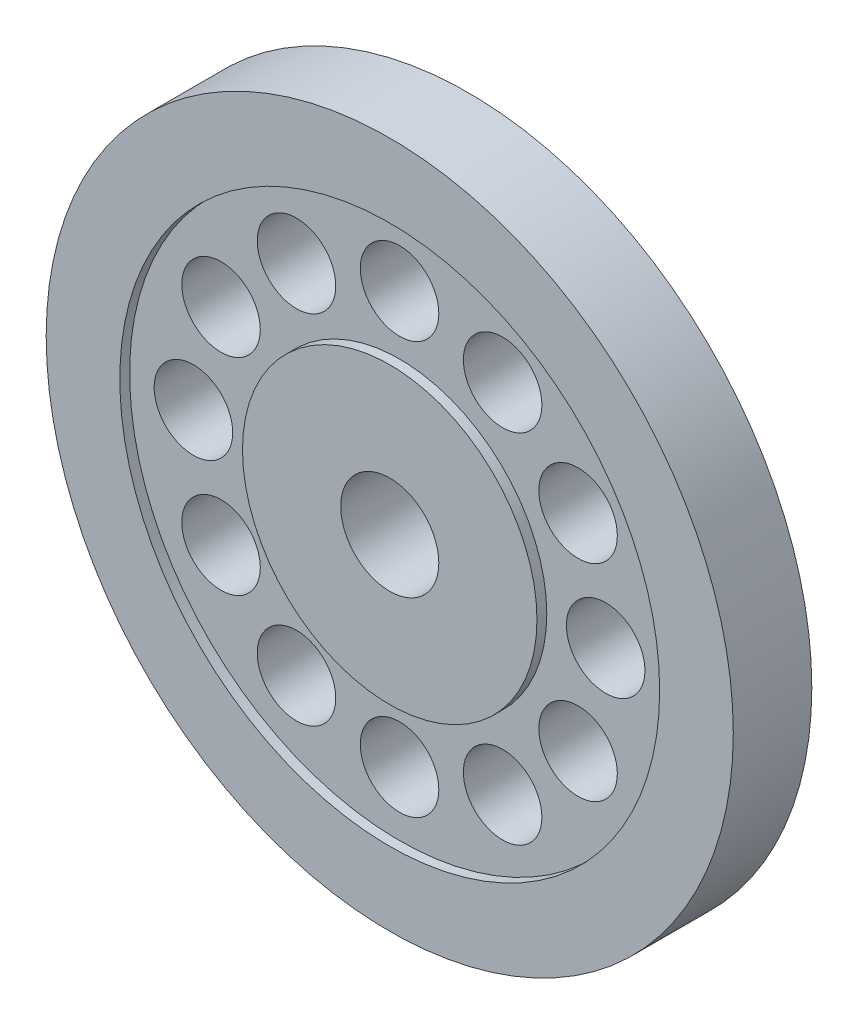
ISO-10303-21;
HEADER;
FILE_DESCRIPTION(('STEP AP214'),'2;1');
FILE_NAME('part.step','',(''),(''),'','','');
FILE_SCHEMA(('AUTOMOTIVE_DESIGN { 1 0 10303 214 1 1 1 1 }'));
ENDSEC;
DATA;
#1=APPLICATION_CONTEXT('core data for automotive mechanical design processes');
#2=APPLICATION_PROTOCOL_DEFINITION('international standard','automotive_design',2000,#1);
#3=PRODUCT_CONTEXT('',#1,'mechanical');
#4=PRODUCT('Part','Part','',(#3));
#5=PRODUCT_RELATED_PRODUCT_CATEGORY('part','',(#4));
#6=PRODUCT_DEFINITION_FORMATION('','',#4);
#7=PRODUCT_DEFINITION_CONTEXT('part definition',#1,'design');
#8=PRODUCT_DEFINITION('design','',#6,#7);
#9=PRODUCT_DEFINITION_SHAPE('','',#8);
#10=(LENGTH_UNIT() NAMED_UNIT(*) SI_UNIT(.MILLI.,.METRE.));
#11=(NAMED_UNIT(*) PLANE_ANGLE_UNIT() SI_UNIT($,.RADIAN.));
#12=(NAMED_UNIT(*) SI_UNIT($,.STERADIAN.) SOLID_ANGLE_UNIT());
#13=UNCERTAINTY_MEASURE_WITH_UNIT(LENGTH_MEASURE(1.E-05),#10,'distance_accuracy_value','');
#14=(GEOMETRIC_REPRESENTATION_CONTEXT(3) GLOBAL_UNCERTAINTY_ASSIGNED_CONTEXT((#13)) GLOBAL_UNIT_ASSIGNED_CONTEXT((#10,
#11,#12)) REPRESENTATION_CONTEXT('',''));
#15=CARTESIAN_POINT('',(0.,0.,0.));
#16=DIRECTION('',(0.,0.,1.));
#17=DIRECTION('',(1.,0.,0.));
#18=AXIS2_PLACEMENT_3D('',#15,#16,#17);
#19=CARTESIAN_POINT('',(0.,0.,8.));
#20=DIRECTION('',(0.,0.,-1.));
#21=DIRECTION('',(-1.,0.,0.));
#22=AXIS2_PLACEMENT_3D('',#19,#20,#21);
#23=CYLINDRICAL_SURFACE('',#22,35.);
#24=CARTESIAN_POINT('',(0.,0.,8.));
#25=DIRECTION('',(0.,0.,1.));
#26=DIRECTION('',(1.,0.,0.));
#27=AXIS2_PLACEMENT_3D('',#24,#25,#26);
#28=CIRCLE('',#27,35.);
#29=CARTESIAN_POINT('',(35.,0.,8.));
#30=VERTEX_POINT('',#29);
#31=EDGE_CURVE('E10',#30,#30,#28,.T.);
#32=ORIENTED_EDGE('',*,*,#31,.F.);
#33=EDGE_LOOP('',(#32));
#34=FACE_BOUND('',#33,.T.);
#35=CARTESIAN_POINT('',(0.,0.,0.));
#36=DIRECTION('',(0.,0.,1.));
#37=DIRECTION('',(1.,0.,0.));
#38=AXIS2_PLACEMENT_3D('',#35,#36,#37);
#39=CIRCLE('',#38,35.);
#40=CARTESIAN_POINT('',(35.,0.,0.));
#41=VERTEX_POINT('',#40);
#42=EDGE_CURVE('E39',#41,#41,#39,.T.);
#43=ORIENTED_EDGE('',*,*,#42,.T.);
#44=EDGE_LOOP('',(#43));
#45=FACE_BOUND('',#44,.T.);
#46=ADVANCED_FACE('F36',(#34,#45),#23,.T.);
#47=CARTESIAN_POINT('',(0.,0.,8.));
#48=DIRECTION('',(0.,0.,1.));
#49=DIRECTION('',(1.,0.,0.));
#50=AXIS2_PLACEMENT_3D('',#47,#48,#49);
#51=PLANE('',#50);
#52=CARTESIAN_POINT('',(0.,0.,8.));
#53=DIRECTION('',(0.,0.,1.));
#54=DIRECTION('',(1.,0.,0.));
#55=AXIS2_PLACEMENT_3D('',#52,#53,#54);
#56=CIRCLE('',#55,27.5);
#57=CARTESIAN_POINT('',(27.5,0.,8.));
#58=VERTEX_POINT('',#57);
#59=EDGE_CURVE('E51',#58,#58,#56,.T.);
#60=ORIENTED_EDGE('',*,*,#59,.F.);
#61=EDGE_LOOP('',(#60));
#62=FACE_BOUND('',#61,.T.);
#63=ORIENTED_EDGE('',*,*,#31,.T.);
#64=EDGE_LOOP('',(#63));
#65=FACE_BOUND('',#64,.T.);
#66=ADVANCED_FACE('F194',(#62,#65),#51,.T.);
#67=CARTESIAN_POINT('',(0.,0.,0.));
#68=DIRECTION('',(0.,0.,1.));
#69=DIRECTION('',(1.,0.,0.));
#70=AXIS2_PLACEMENT_3D('',#67,#68,#69);
#71=PLANE('',#70);
#72=CARTESIAN_POINT('',(-10.4999999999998,18.1865334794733,0.));
#73=DIRECTION('',(0.,0.,1.));
#74=DIRECTION('',(1.,0.,0.));
#75=AXIS2_PLACEMENT_3D('',#72,#73,#74);
#76=CIRCLE('',#75,4.);
#77=CARTESIAN_POINT('',(-6.49999999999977,18.1865334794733,0.));
#78=VERTEX_POINT('',#77);
#79=EDGE_CURVE('E147',#78,#78,#76,.T.);
#80=ORIENTED_EDGE('',*,*,#79,.T.);
#81=EDGE_LOOP('',(#80));
#82=FACE_BOUND('',#81,.T.);
#83=CARTESIAN_POINT('',(-18.1865334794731,10.5000000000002,0.));
#84=DIRECTION('',(0.,0.,1.));
#85=DIRECTION('',(1.,0.,0.));
#86=AXIS2_PLACEMENT_3D('',#83,#84,#85);
#87=CIRCLE('',#86,4.);
#88=CARTESIAN_POINT('',(-14.1865334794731,10.5000000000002,0.));
#89=VERTEX_POINT('',#88);
#90=EDGE_CURVE('E141',#89,#89,#87,.T.);
#91=ORIENTED_EDGE('',*,*,#90,.T.);
#92=EDGE_LOOP('',(#91));
#93=FACE_BOUND('',#92,.T.);
#94=CARTESIAN_POINT('',(-21.,2.19963324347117E-13,0.));
#95=DIRECTION('',(0.,0.,1.));
#96=DIRECTION('',(1.,0.,0.));
#97=AXIS2_PLACEMENT_3D('',#94,#95,#96);
#98=CIRCLE('',#97,4.);
#99=CARTESIAN_POINT('',(-17.,2.19963324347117E-13,0.));
#100=VERTEX_POINT('',#99);
#101=EDGE_CURVE('E135',#100,#100,#98,.T.);
#102=ORIENTED_EDGE('',*,*,#101,.T.);
#103=EDGE_LOOP('',(#102));
#104=FACE_BOUND('',#103,.T.);
#105=CARTESIAN_POINT('',(-18.1865334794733,-10.4999999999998,0.));
#106=DIRECTION('',(0.,0.,1.));
#107=DIRECTION('',(1.,0.,0.));
#108=AXIS2_PLACEMENT_3D('',#105,#106,#107);
#109=CIRCLE('',#108,4.);
#110=CARTESIAN_POINT('',(-14.1865334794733,-10.4999999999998,0.));
#111=VERTEX_POINT('',#110);
#112=EDGE_CURVE('E128',#111,#111,#109,.T.);
#113=ORIENTED_EDGE('',*,*,#112,.T.);
#114=EDGE_LOOP('',(#113));
#115=FACE_BOUND('',#114,.T.);
#116=CARTESIAN_POINT('',(-10.5000000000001,-18.1865334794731,0.));
#117=DIRECTION('',(0.,0.,1.));
#118=DIRECTION('',(1.,0.,0.));
#119=AXIS2_PLACEMENT_3D('',#116,#117,#118);
#120=CIRCLE('',#119,4.);
#121=CARTESIAN_POINT('',(-6.50000000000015,-18.1865334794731,0.));
#122=VERTEX_POINT('',#121);
#123=EDGE_CURVE('E120',#122,#122,#120,.T.);
#124=ORIENTED_EDGE('',*,*,#123,.T.);
#125=EDGE_LOOP('',(#124));
#126=FACE_BOUND('',#125,.T.);
#127=CARTESIAN_POINT('',(0.,-21.,0.));
#128=DIRECTION('',(0.,0.,1.));
#129=DIRECTION('',(1.,0.,0.));
#130=AXIS2_PLACEMENT_3D('',#127,#128,#129);
#131=CIRCLE('',#130,4.);
#132=CARTESIAN_POINT('',(4.,-21.,0.));
#133=VERTEX_POINT('',#132);
#134=EDGE_CURVE('E112',#133,#133,#131,.T.);
#135=ORIENTED_EDGE('',*,*,#134,.T.);
#136=EDGE_LOOP('',(#135));
#137=FACE_BOUND('',#136,.T.);
#138=CARTESIAN_POINT('',(10.4999999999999,-18.1865334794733,0.));
#139=DIRECTION('',(0.,0.,1.));
#140=DIRECTION('',(1.,0.,0.));
#141=AXIS2_PLACEMENT_3D('',#138,#139,#140);
#142=CIRCLE('',#141,4.);
#143=CARTESIAN_POINT('',(14.4999999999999,-18.1865334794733,0.));
#144=VERTEX_POINT('',#143);
#145=EDGE_CURVE('E104',#144,#144,#142,.T.);
#146=ORIENTED_EDGE('',*,*,#145,.T.);
#147=EDGE_LOOP('',(#146));
#148=FACE_BOUND('',#147,.T.);
#149=CARTESIAN_POINT('',(18.1865334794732,-10.5000000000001,0.));
#150=DIRECTION('',(0.,0.,1.));
#151=DIRECTION('',(1.,0.,0.));
#152=AXIS2_PLACEMENT_3D('',#149,#150,#151);
#153=CIRCLE('',#152,4.);
#154=CARTESIAN_POINT('',(22.1865334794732,-10.5000000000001,0.));
#155=VERTEX_POINT('',#154);
#156=EDGE_CURVE('E96',#155,#155,#153,.T.);
#157=ORIENTED_EDGE('',*,*,#156,.T.);
#158=EDGE_LOOP('',(#157));
#159=FACE_BOUND('',#158,.T.);
#160=CARTESIAN_POINT('',(21.,0.,0.));
#161=DIRECTION('',(0.,0.,1.));
#162=DIRECTION('',(1.,0.,0.));
#163=AXIS2_PLACEMENT_3D('',#160,#161,#162);
#164=CIRCLE('',#163,4.);
#165=CARTESIAN_POINT('',(25.,0.,0.));
#166=VERTEX_POINT('',#165);
#167=EDGE_CURVE('E90',#166,#166,#164,.T.);
#168=ORIENTED_EDGE('',*,*,#167,.T.);
#169=EDGE_LOOP('',(#168));
#170=FACE_BOUND('',#169,.T.);
#171=CARTESIAN_POINT('',(18.1865334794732,10.5,0.));
#172=DIRECTION('',(0.,0.,1.));
#173=DIRECTION('',(1.,0.,0.));
#174=AXIS2_PLACEMENT_3D('',#171,#172,#173);
#175=CIRCLE('',#174,4.);
#176=CARTESIAN_POINT('',(22.1865334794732,10.5,0.));
#177=VERTEX_POINT('',#176);
#178=EDGE_CURVE('E84',#177,#177,#175,.T.);
#179=ORIENTED_EDGE('',*,*,#178,.T.);
#180=EDGE_LOOP('',(#179));
#181=FACE_BOUND('',#180,.T.);
#182=CARTESIAN_POINT('',(10.5,18.1865334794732,0.));
#183=DIRECTION('',(0.,0.,1.));
#184=DIRECTION('',(1.,0.,0.));
#185=AXIS2_PLACEMENT_3D('',#182,#183,#184);
#186=CIRCLE('',#185,4.);
#187=CARTESIAN_POINT('',(14.5,18.1865334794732,0.));
#188=VERTEX_POINT('',#187);
#189=EDGE_CURVE('E78',#188,#188,#186,.T.);
#190=ORIENTED_EDGE('',*,*,#189,.T.);
#191=EDGE_LOOP('',(#190));
#192=FACE_BOUND('',#191,.T.);
#193=CARTESIAN_POINT('',(0.,21.,0.));
#194=DIRECTION('',(0.,0.,1.));
#195=DIRECTION('',(1.,0.,0.));
#196=AXIS2_PLACEMENT_3D('',#193,#194,#195);
#197=CIRCLE('',#196,4.);
#198=CARTESIAN_POINT('',(4.,21.,0.));
#199=VERTEX_POINT('',#198);
#200=EDGE_CURVE('E72',#199,#199,#197,.T.);
#201=ORIENTED_EDGE('',*,*,#200,.T.);
#202=EDGE_LOOP('',(#201));
#203=FACE_BOUND('',#202,.T.);
#204=CARTESIAN_POINT('',(0.,0.,0.));
#205=DIRECTION('',(0.,0.,1.));
#206=DIRECTION('',(1.,0.,0.));
#207=AXIS2_PLACEMENT_3D('',#204,#205,#206);
#208=CIRCLE('',#207,5.);
#209=CARTESIAN_POINT('',(5.,0.,0.));
#210=VERTEX_POINT('',#209);
#211=EDGE_CURVE('E63',#210,#210,#208,.T.);
#212=ORIENTED_EDGE('',*,*,#211,.T.);
#213=EDGE_LOOP('',(#212));
#214=FACE_BOUND('',#213,.T.);
#215=ORIENTED_EDGE('',*,*,#42,.F.);
#216=EDGE_LOOP('',(#215));
#217=FACE_BOUND('',#216,.T.);
#218=ADVANCED_FACE('F190',(#82,#93,#104,#115,#126,#137,#148,#159,#170,#181,#192,#203,#214,#217),
#71,.F.);
#219=CARTESIAN_POINT('',(0.,0.,7.));
#220=DIRECTION('',(0.,0.,1.));
#221=DIRECTION('',(1.,0.,0.));
#222=AXIS2_PLACEMENT_3D('',#219,#220,#221);
#223=CYLINDRICAL_SURFACE('',#222,27.5);
#224=CARTESIAN_POINT('',(0.,0.,7.));
#225=DIRECTION('',(0.,0.,1.));
#226=DIRECTION('',(1.,0.,0.));
#227=AXIS2_PLACEMENT_3D('',#224,#225,#226);
#228=CIRCLE('',#227,27.5);
#229=CARTESIAN_POINT('',(27.5,0.,7.));
#230=VERTEX_POINT('',#229);
#231=EDGE_CURVE('E49',#230,#230,#228,.T.);
#232=ORIENTED_EDGE('',*,*,#231,.F.);
#233=EDGE_LOOP('',(#232));
#234=FACE_BOUND('',#233,.T.);
#235=ORIENTED_EDGE('',*,*,#59,.T.);
#236=EDGE_LOOP('',(#235));
#237=FACE_BOUND('',#236,.T.);
#238=ADVANCED_FACE('F160',(#234,#237),#223,.F.);
#239=CARTESIAN_POINT('',(0.,0.,7.));
#240=DIRECTION('',(0.,0.,1.));
#241=DIRECTION('',(1.,0.,0.));
#242=AXIS2_PLACEMENT_3D('',#239,#240,#241);
#243=PLANE('',#242);
#244=CARTESIAN_POINT('',(-10.4999999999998,18.1865334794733,7.));
#245=DIRECTION('',(0.,0.,1.));
#246=DIRECTION('',(1.,0.,0.));
#247=AXIS2_PLACEMENT_3D('',#244,#245,#246);
#248=CIRCLE('',#247,4.);
#249=CARTESIAN_POINT('',(-6.49999999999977,18.1865334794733,7.));
#250=VERTEX_POINT('',#249);
#251=EDGE_CURVE('E150',#250,#250,#248,.T.);
#252=ORIENTED_EDGE('',*,*,#251,.F.);
#253=EDGE_LOOP('',(#252));
#254=FACE_BOUND('',#253,.T.);
#255=CARTESIAN_POINT('',(-18.1865334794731,10.5000000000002,7.));
#256=DIRECTION('',(0.,0.,1.));
#257=DIRECTION('',(1.,0.,0.));
#258=AXIS2_PLACEMENT_3D('',#255,#256,#257);
#259=CIRCLE('',#258,4.);
#260=CARTESIAN_POINT('',(-14.1865334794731,10.5000000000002,7.));
#261=VERTEX_POINT('',#260);
#262=EDGE_CURVE('E144',#261,#261,#259,.T.);
#263=ORIENTED_EDGE('',*,*,#262,.F.);
#264=EDGE_LOOP('',(#263));
#265=FACE_BOUND('',#264,.T.);
#266=CARTESIAN_POINT('',(-21.,2.19963324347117E-13,7.));
#267=DIRECTION('',(0.,0.,1.));
#268=DIRECTION('',(1.,0.,0.));
#269=AXIS2_PLACEMENT_3D('',#266,#267,#268);
#270=CIRCLE('',#269,4.);
#271=CARTESIAN_POINT('',(-17.,2.19963324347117E-13,7.));
#272=VERTEX_POINT('',#271);
#273=EDGE_CURVE('E138',#272,#272,#270,.T.);
#274=ORIENTED_EDGE('',*,*,#273,.F.);
#275=EDGE_LOOP('',(#274));
#276=FACE_BOUND('',#275,.T.);
#277=CARTESIAN_POINT('',(-18.1865334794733,-10.4999999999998,7.));
#278=DIRECTION('',(0.,0.,1.));
#279=DIRECTION('',(1.,0.,0.));
#280=AXIS2_PLACEMENT_3D('',#277,#278,#279);
#281=CIRCLE('',#280,4.);
#282=CARTESIAN_POINT('',(-14.1865334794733,-10.4999999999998,7.));
#283=VERTEX_POINT('',#282);
#284=EDGE_CURVE('E131',#283,#283,#281,.T.);
#285=ORIENTED_EDGE('',*,*,#284,.F.);
#286=EDGE_LOOP('',(#285));
#287=FACE_BOUND('',#286,.T.);
#288=CARTESIAN_POINT('',(-10.5000000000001,-18.1865334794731,7.));
#289=DIRECTION('',(0.,0.,1.));
#290=DIRECTION('',(1.,0.,0.));
#291=AXIS2_PLACEMENT_3D('',#288,#289,#290);
#292=CIRCLE('',#291,4.);
#293=CARTESIAN_POINT('',(-6.50000000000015,-18.1865334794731,7.));
#294=VERTEX_POINT('',#293);
#295=EDGE_CURVE('E124',#294,#294,#292,.T.);
#296=ORIENTED_EDGE('',*,*,#295,.F.);
#297=EDGE_LOOP('',(#296));
#298=FACE_BOUND('',#297,.T.);
#299=CARTESIAN_POINT('',(0.,-21.,7.));
#300=DIRECTION('',(0.,0.,1.));
#301=DIRECTION('',(1.,0.,0.));
#302=AXIS2_PLACEMENT_3D('',#299,#300,#301);
#303=CIRCLE('',#302,4.);
#304=CARTESIAN_POINT('',(4.,-21.,7.));
#305=VERTEX_POINT('',#304);
#306=EDGE_CURVE('E116',#305,#305,#303,.T.);
#307=ORIENTED_EDGE('',*,*,#306,.F.);
#308=EDGE_LOOP('',(#307));
#309=FACE_BOUND('',#308,.T.);
#310=CARTESIAN_POINT('',(10.4999999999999,-18.1865334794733,7.));
#311=DIRECTION('',(0.,0.,1.));
#312=DIRECTION('',(1.,0.,0.));
#313=AXIS2_PLACEMENT_3D('',#310,#311,#312);
#314=CIRCLE('',#313,4.);
#315=CARTESIAN_POINT('',(14.4999999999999,-18.1865334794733,7.));
#316=VERTEX_POINT('',#315);
#317=EDGE_CURVE('E108',#316,#316,#314,.T.);
#318=ORIENTED_EDGE('',*,*,#317,.F.);
#319=EDGE_LOOP('',(#318));
#320=FACE_BOUND('',#319,.T.);
#321=CARTESIAN_POINT('',(18.1865334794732,-10.5000000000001,7.));
#322=DIRECTION('',(0.,0.,1.));
#323=DIRECTION('',(1.,0.,0.));
#324=AXIS2_PLACEMENT_3D('',#321,#322,#323);
#325=CIRCLE('',#324,4.);
#326=CARTESIAN_POINT('',(22.1865334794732,-10.5000000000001,7.));
#327=VERTEX_POINT('',#326);
#328=EDGE_CURVE('E100',#327,#327,#325,.T.);
#329=ORIENTED_EDGE('',*,*,#328,.F.);
#330=EDGE_LOOP('',(#329));
#331=FACE_BOUND('',#330,.T.);
#332=CARTESIAN_POINT('',(21.,0.,7.));
#333=DIRECTION('',(0.,0.,1.));
#334=DIRECTION('',(1.,0.,0.));
#335=AXIS2_PLACEMENT_3D('',#332,#333,#334);
#336=CIRCLE('',#335,4.);
#337=CARTESIAN_POINT('',(25.,0.,7.));
#338=VERTEX_POINT('',#337);
#339=EDGE_CURVE('E93',#338,#338,#336,.T.);
#340=ORIENTED_EDGE('',*,*,#339,.F.);
#341=EDGE_LOOP('',(#340));
#342=FACE_BOUND('',#341,.T.);
#343=CARTESIAN_POINT('',(18.1865334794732,10.5,7.));
#344=DIRECTION('',(0.,0.,1.));
#345=DIRECTION('',(1.,0.,0.));
#346=AXIS2_PLACEMENT_3D('',#343,#344,#345);
#347=CIRCLE('',#346,4.);
#348=CARTESIAN_POINT('',(22.1865334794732,10.5,7.));
#349=VERTEX_POINT('',#348);
#350=EDGE_CURVE('E87',#349,#349,#347,.T.);
#351=ORIENTED_EDGE('',*,*,#350,.F.);
#352=EDGE_LOOP('',(#351));
#353=FACE_BOUND('',#352,.T.);
#354=CARTESIAN_POINT('',(10.5,18.1865334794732,7.));
#355=DIRECTION('',(0.,0.,1.));
#356=DIRECTION('',(1.,0.,0.));
#357=AXIS2_PLACEMENT_3D('',#354,#355,#356);
#358=CIRCLE('',#357,3.99999999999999);
#359=CARTESIAN_POINT('',(14.5,18.1865334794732,7.));
#360=VERTEX_POINT('',#359);
#361=EDGE_CURVE('E81',#360,#360,#358,.T.);
#362=ORIENTED_EDGE('',*,*,#361,.F.);
#363=EDGE_LOOP('',(#362));
#364=FACE_BOUND('',#363,.T.);
#365=CARTESIAN_POINT('',(0.,21.,7.));
#366=DIRECTION('',(0.,0.,1.));
#367=DIRECTION('',(1.,0.,0.));
#368=AXIS2_PLACEMENT_3D('',#365,#366,#367);
#369=CIRCLE('',#368,4.);
#370=CARTESIAN_POINT('',(4.,21.,7.));
#371=VERTEX_POINT('',#370);
#372=EDGE_CURVE('E75',#371,#371,#369,.T.);
#373=ORIENTED_EDGE('',*,*,#372,.F.);
#374=EDGE_LOOP('',(#373));
#375=FACE_BOUND('',#374,.T.);
#376=CARTESIAN_POINT('',(0.,0.,7.));
#377=DIRECTION('',(0.,0.,1.));
#378=DIRECTION('',(1.,0.,0.));
#379=AXIS2_PLACEMENT_3D('',#376,#377,#378);
#380=CIRCLE('',#379,15.);
#381=CARTESIAN_POINT('',(15.,0.,7.));
#382=VERTEX_POINT('',#381);
#383=EDGE_CURVE('E55',#382,#382,#380,.T.);
#384=ORIENTED_EDGE('',*,*,#383,.F.);
#385=EDGE_LOOP('',(#384));
#386=FACE_BOUND('',#385,.T.);
#387=ORIENTED_EDGE('',*,*,#231,.T.);
#388=EDGE_LOOP('',(#387));
#389=FACE_BOUND('',#388,.T.);
#390=ADVANCED_FACE('F156',(#254,#265,#276,#287,#298,#309,#320,#331,#342,#353,#364,#375,#386,
#389),#243,.T.);
#391=CARTESIAN_POINT('',(0.,0.,7.));
#392=DIRECTION('',(0.,0.,1.));
#393=DIRECTION('',(1.,0.,0.));
#394=AXIS2_PLACEMENT_3D('',#391,#392,#393);
#395=CYLINDRICAL_SURFACE('',#394,15.);
#396=ORIENTED_EDGE('',*,*,#383,.T.);
#397=EDGE_LOOP('',(#396));
#398=FACE_BOUND('',#397,.T.);
#399=CARTESIAN_POINT('',(0.,0.,8.));
#400=DIRECTION('',(0.,0.,1.));
#401=DIRECTION('',(1.,0.,0.));
#402=AXIS2_PLACEMENT_3D('',#399,#400,#401);
#403=CIRCLE('',#402,15.);
#404=CARTESIAN_POINT('',(15.,0.,8.));
#405=VERTEX_POINT('',#404);
#406=EDGE_CURVE('E59',#405,#405,#403,.T.);
#407=ORIENTED_EDGE('',*,*,#406,.F.);
#408=EDGE_LOOP('',(#407));
#409=FACE_BOUND('',#408,.T.);
#410=ADVANCED_FACE('F159',(#398,#409),#395,.T.);
#411=CARTESIAN_POINT('',(0.,0.,8.));
#412=DIRECTION('',(0.,0.,1.));
#413=DIRECTION('',(1.,0.,0.));
#414=AXIS2_PLACEMENT_3D('',#411,#412,#413);
#415=CIRCLE('',#414,5.);
#416=CARTESIAN_POINT('',(5.,0.,8.));
#417=VERTEX_POINT('',#416);
#418=EDGE_CURVE('E69',#417,#417,#415,.T.);
#419=ORIENTED_EDGE('',*,*,#418,.F.);
#420=EDGE_LOOP('',(#419));
#421=FACE_BOUND('',#420,.T.);
#422=ORIENTED_EDGE('',*,*,#406,.T.);
#423=EDGE_LOOP('',(#422));
#424=FACE_BOUND('',#423,.T.);
#425=ADVANCED_FACE('F197',(#421,#424),#51,.T.);
#426=CARTESIAN_POINT('',(0.,0.,8.));
#427=DIRECTION('',(0.,0.,1.));
#428=DIRECTION('',(1.,0.,0.));
#429=AXIS2_PLACEMENT_3D('',#426,#427,#428);
#430=CYLINDRICAL_SURFACE('',#429,5.);
#431=ORIENTED_EDGE('',*,*,#211,.F.);
#432=EDGE_LOOP('',(#431));
#433=FACE_BOUND('',#432,.T.);
#434=ORIENTED_EDGE('',*,*,#418,.T.);
#435=EDGE_LOOP('',(#434));
#436=FACE_BOUND('',#435,.T.);
#437=ADVANCED_FACE('F205',(#433,#436),#430,.F.);
#438=CARTESIAN_POINT('',(0.,21.,7.));
#439=DIRECTION('',(0.,0.,1.));
#440=DIRECTION('',(1.,0.,0.));
#441=AXIS2_PLACEMENT_3D('',#438,#439,#440);
#442=CYLINDRICAL_SURFACE('',#441,4.);
#443=ORIENTED_EDGE('',*,*,#200,.F.);
#444=EDGE_LOOP('',(#443));
#445=FACE_BOUND('',#444,.T.);
#446=ORIENTED_EDGE('',*,*,#372,.T.);
#447=EDGE_LOOP('',(#446));
#448=FACE_BOUND('',#447,.T.);
#449=ADVANCED_FACE('F211',(#445,#448),#442,.F.);
#450=CARTESIAN_POINT('',(10.5,18.1865334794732,7.));
#451=DIRECTION('',(0.,0.,1.));
#452=DIRECTION('',(1.,0.,0.));
#453=AXIS2_PLACEMENT_3D('',#450,#451,#452);
#454=CYLINDRICAL_SURFACE('',#453,4.);
#455=ORIENTED_EDGE('',*,*,#189,.F.);
#456=EDGE_LOOP('',(#455));
#457=FACE_BOUND('',#456,.T.);
#458=ORIENTED_EDGE('',*,*,#361,.T.);
#459=EDGE_LOOP('',(#458));
#460=FACE_BOUND('',#459,.T.);
#461=ADVANCED_FACE('F226',(#457,#460),#454,.F.);
#462=CARTESIAN_POINT('',(18.1865334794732,10.5,7.));
#463=DIRECTION('',(0.,0.,1.));
#464=DIRECTION('',(1.,0.,0.));
#465=AXIS2_PLACEMENT_3D('',#462,#463,#464);
#466=CYLINDRICAL_SURFACE('',#465,4.);
#467=ORIENTED_EDGE('',*,*,#178,.F.);
#468=EDGE_LOOP('',(#467));
#469=FACE_BOUND('',#468,.T.);
#470=ORIENTED_EDGE('',*,*,#350,.T.);
#471=EDGE_LOOP('',(#470));
#472=FACE_BOUND('',#471,.T.);
#473=ADVANCED_FACE('F230',(#469,#472),#466,.F.);
#474=CARTESIAN_POINT('',(21.,0.,7.));
#475=DIRECTION('',(0.,0.,1.));
#476=DIRECTION('',(1.,0.,0.));
#477=AXIS2_PLACEMENT_3D('',#474,#475,#476);
#478=CYLINDRICAL_SURFACE('',#477,4.);
#479=ORIENTED_EDGE('',*,*,#167,.F.);
#480=EDGE_LOOP('',(#479));
#481=FACE_BOUND('',#480,.T.);
#482=ORIENTED_EDGE('',*,*,#339,.T.);
#483=EDGE_LOOP('',(#482));
#484=FACE_BOUND('',#483,.T.);
#485=ADVANCED_FACE('F234',(#481,#484),#478,.F.);
#486=CARTESIAN_POINT('',(18.1865334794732,-10.5000000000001,7.));
#487=DIRECTION('',(0.,0.,1.));
#488=DIRECTION('',(1.,0.,0.));
#489=AXIS2_PLACEMENT_3D('',#486,#487,#488);
#490=CYLINDRICAL_SURFACE('',#489,4.);
#491=ORIENTED_EDGE('',*,*,#156,.F.);
#492=EDGE_LOOP('',(#491));
#493=FACE_BOUND('',#492,.T.);
#494=ORIENTED_EDGE('',*,*,#328,.T.);
#495=EDGE_LOOP('',(#494));
#496=FACE_BOUND('',#495,.T.);
#497=ADVANCED_FACE('F238',(#493,#496),#490,.F.);
#498=CARTESIAN_POINT('',(10.4999999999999,-18.1865334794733,7.));
#499=DIRECTION('',(0.,0.,1.));
#500=DIRECTION('',(1.,0.,0.));
#501=AXIS2_PLACEMENT_3D('',#498,#499,#500);
#502=CYLINDRICAL_SURFACE('',#501,4.);
#503=ORIENTED_EDGE('',*,*,#145,.F.);
#504=EDGE_LOOP('',(#503));
#505=FACE_BOUND('',#504,.T.);
#506=ORIENTED_EDGE('',*,*,#317,.T.);
#507=EDGE_LOOP('',(#506));
#508=FACE_BOUND('',#507,.T.);
#509=ADVANCED_FACE('F242',(#505,#508),#502,.F.);
#510=CARTESIAN_POINT('',(0.,-21.,7.));
#511=DIRECTION('',(0.,0.,1.));
#512=DIRECTION('',(1.,0.,0.));
#513=AXIS2_PLACEMENT_3D('',#510,#511,#512);
#514=CYLINDRICAL_SURFACE('',#513,4.);
#515=ORIENTED_EDGE('',*,*,#134,.F.);
#516=EDGE_LOOP('',(#515));
#517=FACE_BOUND('',#516,.T.);
#518=ORIENTED_EDGE('',*,*,#306,.T.);
#519=EDGE_LOOP('',(#518));
#520=FACE_BOUND('',#519,.T.);
#521=ADVANCED_FACE('F246',(#517,#520),#514,.F.);
#522=CARTESIAN_POINT('',(-10.5000000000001,-18.1865334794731,7.));
#523=DIRECTION('',(0.,0.,1.));
#524=DIRECTION('',(1.,0.,0.));
#525=AXIS2_PLACEMENT_3D('',#522,#523,#524);
#526=CYLINDRICAL_SURFACE('',#525,4.);
#527=ORIENTED_EDGE('',*,*,#123,.F.);
#528=EDGE_LOOP('',(#527));
#529=FACE_BOUND('',#528,.T.);
#530=ORIENTED_EDGE('',*,*,#295,.T.);
#531=EDGE_LOOP('',(#530));
#532=FACE_BOUND('',#531,.T.);
#533=ADVANCED_FACE('F250',(#529,#532),#526,.F.);
#534=CARTESIAN_POINT('',(-18.1865334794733,-10.4999999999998,7.));
#535=DIRECTION('',(0.,0.,1.));
#536=DIRECTION('',(1.,0.,0.));
#537=AXIS2_PLACEMENT_3D('',#534,#535,#536);
#538=CYLINDRICAL_SURFACE('',#537,4.);
#539=ORIENTED_EDGE('',*,*,#112,.F.);
#540=EDGE_LOOP('',(#539));
#541=FACE_BOUND('',#540,.T.);
#542=ORIENTED_EDGE('',*,*,#284,.T.);
#543=EDGE_LOOP('',(#542));
#544=FACE_BOUND('',#543,.T.);
#545=ADVANCED_FACE('F254',(#541,#544),#538,.F.);
#546=CARTESIAN_POINT('',(-21.,2.19963324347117E-13,7.));
#547=DIRECTION('',(0.,0.,1.));
#548=DIRECTION('',(1.,0.,0.));
#549=AXIS2_PLACEMENT_3D('',#546,#547,#548);
#550=CYLINDRICAL_SURFACE('',#549,4.);
#551=ORIENTED_EDGE('',*,*,#101,.F.);
#552=EDGE_LOOP('',(#551));
#553=FACE_BOUND('',#552,.T.);
#554=ORIENTED_EDGE('',*,*,#273,.T.);
#555=EDGE_LOOP('',(#554));
#556=FACE_BOUND('',#555,.T.);
#557=ADVANCED_FACE('F258',(#553,#556),#550,.F.);
#558=CARTESIAN_POINT('',(-18.1865334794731,10.5000000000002,7.));
#559=DIRECTION('',(0.,0.,1.));
#560=DIRECTION('',(1.,0.,0.));
#561=AXIS2_PLACEMENT_3D('',#558,#559,#560);
#562=CYLINDRICAL_SURFACE('',#561,4.);
#563=ORIENTED_EDGE('',*,*,#90,.F.);
#564=EDGE_LOOP('',(#563));
#565=FACE_BOUND('',#564,.T.);
#566=ORIENTED_EDGE('',*,*,#262,.T.);
#567=EDGE_LOOP('',(#566));
#568=FACE_BOUND('',#567,.T.);
#569=ADVANCED_FACE('F262',(#565,#568),#562,.F.);
#570=CARTESIAN_POINT('',(-10.4999999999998,18.1865334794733,7.));
#571=DIRECTION('',(0.,0.,1.));
#572=DIRECTION('',(1.,0.,0.));
#573=AXIS2_PLACEMENT_3D('',#570,#571,#572);
#574=CYLINDRICAL_SURFACE('',#573,4.);
#575=ORIENTED_EDGE('',*,*,#79,.F.);
#576=EDGE_LOOP('',(#575));
#577=FACE_BOUND('',#576,.T.);
#578=ORIENTED_EDGE('',*,*,#251,.T.);
#579=EDGE_LOOP('',(#578));
#580=FACE_BOUND('',#579,.T.);
#581=ADVANCED_FACE('F154',(#577,#580),#574,.F.);
#582=CLOSED_SHELL('',(#46,#66,#218,#238,#390,#410,#425,#437,#449,#461,#473,#485,#497,#509,#521,
#533,#545,#557,#569,#581));
#583=MANIFOLD_SOLID_BREP('B2',#582);
#584=ADVANCED_BREP_SHAPE_REPRESENTATION('',(#18,#583),#14);
#585=SHAPE_DEFINITION_REPRESENTATION(#9,#584);
ENDSEC;
END-ISO-10303-21;
